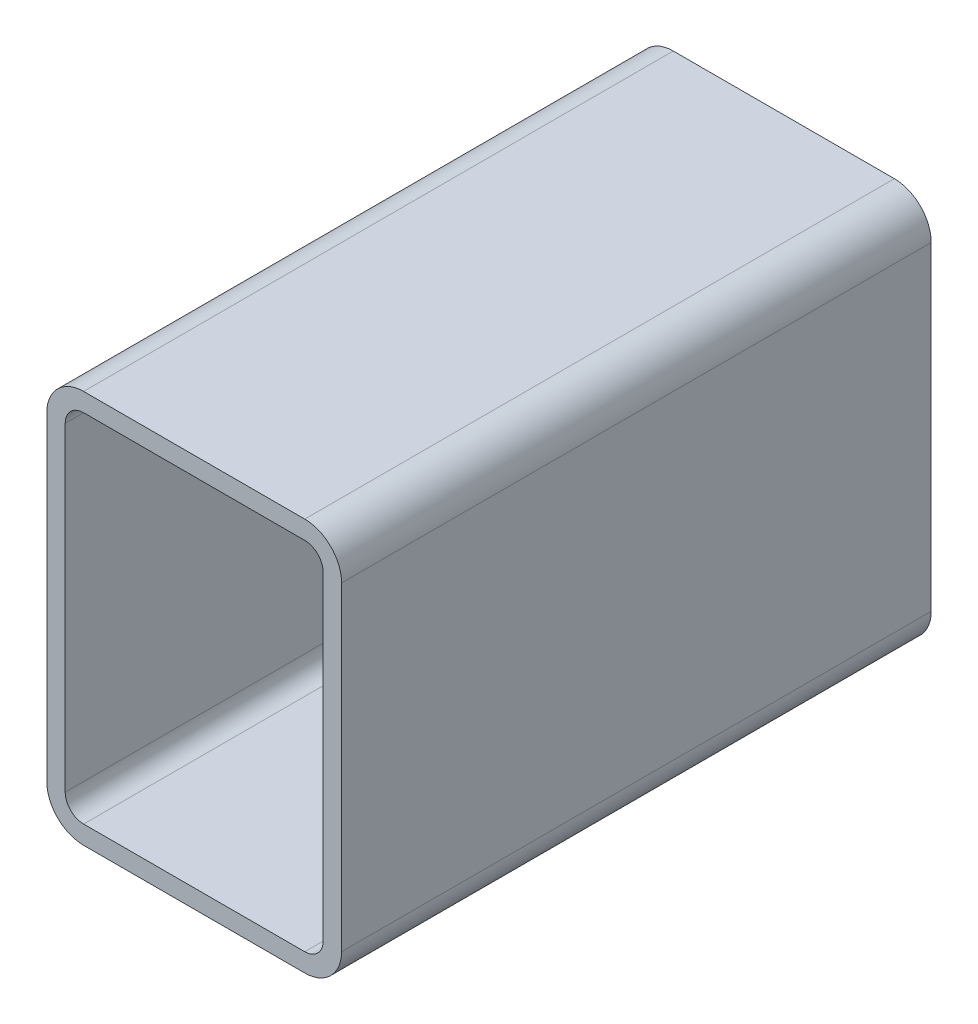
ISO-10303-21;
HEADER;
FILE_DESCRIPTION(('STEP AP214'),'2;1');
FILE_NAME('part.step','',(''),(''),'','','');
FILE_SCHEMA(('AUTOMOTIVE_DESIGN { 1 0 10303 214 1 1 1 1 }'));
ENDSEC;
DATA;
#1=APPLICATION_CONTEXT('core data for automotive mechanical design processes');
#2=APPLICATION_PROTOCOL_DEFINITION('international standard','automotive_design',2000,#1);
#3=PRODUCT_CONTEXT('',#1,'mechanical');
#4=PRODUCT('Part','Part','',(#3));
#5=PRODUCT_RELATED_PRODUCT_CATEGORY('part','',(#4));
#6=PRODUCT_DEFINITION_FORMATION('','',#4);
#7=PRODUCT_DEFINITION_CONTEXT('part definition',#1,'design');
#8=PRODUCT_DEFINITION('design','',#6,#7);
#9=PRODUCT_DEFINITION_SHAPE('','',#8);
#10=(LENGTH_UNIT() NAMED_UNIT(*) SI_UNIT(.MILLI.,.METRE.));
#11=(NAMED_UNIT(*) PLANE_ANGLE_UNIT() SI_UNIT($,.RADIAN.));
#12=(NAMED_UNIT(*) SI_UNIT($,.STERADIAN.) SOLID_ANGLE_UNIT());
#13=UNCERTAINTY_MEASURE_WITH_UNIT(LENGTH_MEASURE(1.E-05),#10,'distance_accuracy_value','');
#14=(GEOMETRIC_REPRESENTATION_CONTEXT(3) GLOBAL_UNCERTAINTY_ASSIGNED_CONTEXT((#13)) GLOBAL_UNIT_ASSIGNED_CONTEXT((#10,
#11,#12)) REPRESENTATION_CONTEXT('',''));
#15=CARTESIAN_POINT('',(0.,0.,0.));
#16=DIRECTION('',(0.,0.,1.));
#17=DIRECTION('',(1.,0.,0.));
#18=AXIS2_PLACEMENT_3D('',#15,#16,#17);
#19=CARTESIAN_POINT('',(19.0973013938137,186.116130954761,304.8));
#20=DIRECTION('',(0.,0.,1.));
#21=DIRECTION('',(1.,0.,0.));
#22=AXIS2_PLACEMENT_3D('',#19,#20,#21);
#23=PLANE('',#22);
#24=CARTESIAN_POINT('',(19.0973013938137,186.116130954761,304.8));
#25=DIRECTION('',(0.,0.,1.));
#26=DIRECTION('',(1.,0.,0.));
#27=AXIS2_PLACEMENT_3D('',#24,#25,#26);
#28=CIRCLE('',#27,19.05);
#29=CARTESIAN_POINT('',(19.0973013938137,205.166130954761,304.8));
#30=VERTEX_POINT('',#29);
#31=CARTESIAN_POINT('',(0.0473013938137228,186.116130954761,304.8));
#32=VERTEX_POINT('',#31);
#33=EDGE_CURVE('E211',#30,#32,#28,.T.);
#34=ORIENTED_EDGE('',*,*,#33,.T.);
#35=DIRECTION('',(0.,-1.,0.));
#36=VECTOR('',#35,1.);
#37=CARTESIAN_POINT('',(0.0473013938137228,21.0161309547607,304.8));
#38=LINE('',#37,#36);
#39=CARTESIAN_POINT('',(0.0473013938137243,21.0161309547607,304.8));
#40=VERTEX_POINT('',#39);
#41=EDGE_CURVE('E214',#32,#40,#38,.T.);
#42=ORIENTED_EDGE('',*,*,#41,.T.);
#43=CARTESIAN_POINT('',(19.0973013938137,21.0161309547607,304.8));
#44=DIRECTION('',(0.,0.,1.));
#45=DIRECTION('',(1.,0.,0.));
#46=AXIS2_PLACEMENT_3D('',#43,#44,#45);
#47=CIRCLE('',#46,19.05);
#48=CARTESIAN_POINT('',(19.0973013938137,1.96613095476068,304.8));
#49=VERTEX_POINT('',#48);
#50=EDGE_CURVE('E217',#40,#49,#47,.T.);
#51=ORIENTED_EDGE('',*,*,#50,.T.);
#52=DIRECTION('',(1.,0.,0.));
#53=VECTOR('',#52,1.);
#54=CARTESIAN_POINT('',(133.397301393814,1.96613095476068,304.8));
#55=LINE('',#54,#53);
#56=CARTESIAN_POINT('',(133.397301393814,1.96613095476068,304.8));
#57=VERTEX_POINT('',#56);
#58=EDGE_CURVE('E219',#49,#57,#55,.T.);
#59=ORIENTED_EDGE('',*,*,#58,.T.);
#60=CARTESIAN_POINT('',(133.397301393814,21.0161309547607,304.8));
#61=DIRECTION('',(0.,0.,1.));
#62=DIRECTION('',(1.,0.,0.));
#63=AXIS2_PLACEMENT_3D('',#60,#61,#62);
#64=CIRCLE('',#63,19.05);
#65=CARTESIAN_POINT('',(152.447301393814,21.0161309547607,304.8));
#66=VERTEX_POINT('',#65);
#67=EDGE_CURVE('E221',#57,#66,#64,.T.);
#68=ORIENTED_EDGE('',*,*,#67,.T.);
#69=DIRECTION('',(0.,1.,0.));
#70=VECTOR('',#69,1.);
#71=CARTESIAN_POINT('',(152.447301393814,186.116130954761,304.8));
#72=LINE('',#71,#70);
#73=CARTESIAN_POINT('',(152.447301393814,186.116130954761,304.8));
#74=VERTEX_POINT('',#73);
#75=EDGE_CURVE('E223',#66,#74,#72,.T.);
#76=ORIENTED_EDGE('',*,*,#75,.T.);
#77=CARTESIAN_POINT('',(133.397301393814,186.116130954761,304.8));
#78=DIRECTION('',(0.,0.,1.));
#79=DIRECTION('',(1.,0.,0.));
#80=AXIS2_PLACEMENT_3D('',#77,#78,#79);
#81=CIRCLE('',#80,19.05);
#82=CARTESIAN_POINT('',(133.397301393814,205.166130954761,304.8));
#83=VERTEX_POINT('',#82);
#84=EDGE_CURVE('E225',#74,#83,#81,.T.);
#85=ORIENTED_EDGE('',*,*,#84,.T.);
#86=DIRECTION('',(-1.,0.,0.));
#87=VECTOR('',#86,1.);
#88=CARTESIAN_POINT('',(19.0973013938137,205.166130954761,304.8));
#89=LINE('',#88,#87);
#90=EDGE_CURVE('E227',#83,#30,#89,.T.);
#91=ORIENTED_EDGE('',*,*,#90,.T.);
#92=EDGE_LOOP('',(#34,#42,#51,#59,#68,#76,#85,#91));
#93=FACE_BOUND('',#92,.T.);
#94=DIRECTION('',(0.,-1.,0.));
#95=VECTOR('',#94,1.);
#96=CARTESIAN_POINT('',(9.57230139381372,21.0161309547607,304.8));
#97=LINE('',#96,#95);
#98=CARTESIAN_POINT('',(9.57230139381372,186.116130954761,304.8));
#99=VERTEX_POINT('',#98);
#100=CARTESIAN_POINT('',(9.57230139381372,21.0161309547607,304.8));
#101=VERTEX_POINT('',#100);
#102=EDGE_CURVE('E154',#99,#101,#97,.T.);
#103=ORIENTED_EDGE('',*,*,#102,.F.);
#104=CARTESIAN_POINT('',(19.0973013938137,186.116130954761,304.8));
#105=DIRECTION('',(0.,0.,1.));
#106=DIRECTION('',(1.,0.,0.));
#107=AXIS2_PLACEMENT_3D('',#104,#105,#106);
#108=CIRCLE('',#107,9.52500000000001);
#109=CARTESIAN_POINT('',(19.0973013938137,195.641130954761,304.8));
#110=VERTEX_POINT('',#109);
#111=EDGE_CURVE('E146',#110,#99,#108,.T.);
#112=ORIENTED_EDGE('',*,*,#111,.F.);
#113=DIRECTION('',(-1.,0.,0.));
#114=VECTOR('',#113,1.);
#115=CARTESIAN_POINT('',(19.0973013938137,195.641130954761,304.8));
#116=LINE('',#115,#114);
#117=CARTESIAN_POINT('',(133.397301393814,195.641130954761,304.8));
#118=VERTEX_POINT('',#117);
#119=EDGE_CURVE('E179',#118,#110,#116,.T.);
#120=ORIENTED_EDGE('',*,*,#119,.F.);
#121=CARTESIAN_POINT('',(133.397301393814,186.116130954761,304.8));
#122=DIRECTION('',(0.,0.,1.));
#123=DIRECTION('',(1.,0.,0.));
#124=AXIS2_PLACEMENT_3D('',#121,#122,#123);
#125=CIRCLE('',#124,9.52500000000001);
#126=CARTESIAN_POINT('',(142.922301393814,186.116130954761,304.8));
#127=VERTEX_POINT('',#126);
#128=EDGE_CURVE('E177',#127,#118,#125,.T.);
#129=ORIENTED_EDGE('',*,*,#128,.F.);
#130=DIRECTION('',(0.,1.,0.));
#131=VECTOR('',#130,1.);
#132=CARTESIAN_POINT('',(142.922301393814,186.116130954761,304.8));
#133=LINE('',#132,#131);
#134=CARTESIAN_POINT('',(142.922301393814,21.0161309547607,304.8));
#135=VERTEX_POINT('',#134);
#136=EDGE_CURVE('E175',#135,#127,#133,.T.);
#137=ORIENTED_EDGE('',*,*,#136,.F.);
#138=CARTESIAN_POINT('',(133.397301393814,21.0161309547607,304.8));
#139=DIRECTION('',(0.,0.,1.));
#140=DIRECTION('',(1.,0.,0.));
#141=AXIS2_PLACEMENT_3D('',#138,#139,#140);
#142=CIRCLE('',#141,9.525);
#143=CARTESIAN_POINT('',(133.397301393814,11.4911309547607,304.8));
#144=VERTEX_POINT('',#143);
#145=EDGE_CURVE('E173',#144,#135,#142,.T.);
#146=ORIENTED_EDGE('',*,*,#145,.F.);
#147=DIRECTION('',(1.,0.,0.));
#148=VECTOR('',#147,1.);
#149=CARTESIAN_POINT('',(133.397301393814,11.4911309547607,304.8));
#150=LINE('',#149,#148);
#151=CARTESIAN_POINT('',(19.0973013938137,11.4911309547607,304.8));
#152=VERTEX_POINT('',#151);
#153=EDGE_CURVE('E169',#152,#144,#150,.T.);
#154=ORIENTED_EDGE('',*,*,#153,.F.);
#155=CARTESIAN_POINT('',(19.0973013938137,21.0161309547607,304.8));
#156=DIRECTION('',(0.,0.,1.));
#157=DIRECTION('',(1.,0.,0.));
#158=AXIS2_PLACEMENT_3D('',#155,#156,#157);
#159=CIRCLE('',#158,9.525);
#160=EDGE_CURVE('E167',#101,#152,#159,.T.);
#161=ORIENTED_EDGE('',*,*,#160,.F.);
#162=EDGE_LOOP('',(#103,#112,#120,#129,#137,#146,#154,#161));
#163=FACE_BOUND('',#162,.T.);
#164=ADVANCED_FACE('F33',(#93,#163),#23,.T.);
#165=CARTESIAN_POINT('',(19.0973013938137,186.116130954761,0.));
#166=DIRECTION('',(0.,0.,1.));
#167=DIRECTION('',(1.,0.,0.));
#168=AXIS2_PLACEMENT_3D('',#165,#166,#167);
#169=PLANE('',#168);
#170=CARTESIAN_POINT('',(19.0973013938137,186.116130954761,0.));
#171=DIRECTION('',(0.,0.,1.));
#172=DIRECTION('',(1.,0.,0.));
#173=AXIS2_PLACEMENT_3D('',#170,#171,#172);
#174=CIRCLE('',#173,19.05);
#175=CARTESIAN_POINT('',(19.0973013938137,205.166130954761,0.));
#176=VERTEX_POINT('',#175);
#177=CARTESIAN_POINT('',(0.0473013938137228,186.116130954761,0.));
#178=VERTEX_POINT('',#177);
#179=EDGE_CURVE('E162',#176,#178,#174,.T.);
#180=ORIENTED_EDGE('',*,*,#179,.F.);
#181=DIRECTION('',(-1.,0.,0.));
#182=VECTOR('',#181,1.);
#183=CARTESIAN_POINT('',(19.0973013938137,205.166130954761,0.));
#184=LINE('',#183,#182);
#185=CARTESIAN_POINT('',(133.397301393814,205.166130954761,0.));
#186=VERTEX_POINT('',#185);
#187=EDGE_CURVE('E215',#186,#176,#184,.T.);
#188=ORIENTED_EDGE('',*,*,#187,.F.);
#189=CARTESIAN_POINT('',(133.397301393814,186.116130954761,0.));
#190=DIRECTION('',(0.,0.,1.));
#191=DIRECTION('',(1.,0.,0.));
#192=AXIS2_PLACEMENT_3D('',#189,#190,#191);
#193=CIRCLE('',#192,19.05);
#194=CARTESIAN_POINT('',(152.447301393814,186.116130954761,0.));
#195=VERTEX_POINT('',#194);
#196=EDGE_CURVE('E242',#195,#186,#193,.T.);
#197=ORIENTED_EDGE('',*,*,#196,.F.);
#198=DIRECTION('',(0.,1.,0.));
#199=VECTOR('',#198,1.);
#200=CARTESIAN_POINT('',(152.447301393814,186.116130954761,0.));
#201=LINE('',#200,#199);
#202=CARTESIAN_POINT('',(152.447301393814,21.0161309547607,0.));
#203=VERTEX_POINT('',#202);
#204=EDGE_CURVE('E240',#203,#195,#201,.T.);
#205=ORIENTED_EDGE('',*,*,#204,.F.);
#206=CARTESIAN_POINT('',(133.397301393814,21.0161309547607,0.));
#207=DIRECTION('',(0.,0.,1.));
#208=DIRECTION('',(1.,0.,0.));
#209=AXIS2_PLACEMENT_3D('',#206,#207,#208);
#210=CIRCLE('',#209,19.05);
#211=CARTESIAN_POINT('',(133.397301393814,1.96613095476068,0.));
#212=VERTEX_POINT('',#211);
#213=EDGE_CURVE('E238',#212,#203,#210,.T.);
#214=ORIENTED_EDGE('',*,*,#213,.F.);
#215=DIRECTION('',(1.,0.,0.));
#216=VECTOR('',#215,1.);
#217=CARTESIAN_POINT('',(133.397301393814,1.96613095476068,0.));
#218=LINE('',#217,#216);
#219=CARTESIAN_POINT('',(19.0973013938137,1.96613095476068,0.));
#220=VERTEX_POINT('',#219);
#221=EDGE_CURVE('E236',#220,#212,#218,.T.);
#222=ORIENTED_EDGE('',*,*,#221,.F.);
#223=CARTESIAN_POINT('',(19.0973013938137,21.0161309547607,0.));
#224=DIRECTION('',(0.,0.,1.));
#225=DIRECTION('',(1.,0.,0.));
#226=AXIS2_PLACEMENT_3D('',#223,#224,#225);
#227=CIRCLE('',#226,19.05);
#228=CARTESIAN_POINT('',(0.0473013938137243,21.0161309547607,0.));
#229=VERTEX_POINT('',#228);
#230=EDGE_CURVE('E234',#229,#220,#227,.T.);
#231=ORIENTED_EDGE('',*,*,#230,.F.);
#232=DIRECTION('',(0.,-1.,0.));
#233=VECTOR('',#232,1.);
#234=CARTESIAN_POINT('',(0.0473013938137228,21.0161309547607,0.));
#235=LINE('',#234,#233);
#236=EDGE_CURVE('E232',#178,#229,#235,.T.);
#237=ORIENTED_EDGE('',*,*,#236,.F.);
#238=EDGE_LOOP('',(#180,#188,#197,#205,#214,#222,#231,#237));
#239=FACE_BOUND('',#238,.T.);
#240=CARTESIAN_POINT('',(19.0973013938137,186.116130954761,0.));
#241=DIRECTION('',(0.,0.,1.));
#242=DIRECTION('',(1.,0.,0.));
#243=AXIS2_PLACEMENT_3D('',#240,#241,#242);
#244=CIRCLE('',#243,9.52500000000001);
#245=CARTESIAN_POINT('',(19.0973013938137,195.641130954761,0.));
#246=VERTEX_POINT('',#245);
#247=CARTESIAN_POINT('',(9.57230139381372,186.116130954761,0.));
#248=VERTEX_POINT('',#247);
#249=EDGE_CURVE('E56',#246,#248,#244,.T.);
#250=ORIENTED_EDGE('',*,*,#249,.T.);
#251=DIRECTION('',(0.,-1.,0.));
#252=VECTOR('',#251,1.);
#253=CARTESIAN_POINT('',(9.57230139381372,21.0161309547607,0.));
#254=LINE('',#253,#252);
#255=CARTESIAN_POINT('',(9.57230139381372,21.0161309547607,0.));
#256=VERTEX_POINT('',#255);
#257=EDGE_CURVE('E161',#248,#256,#254,.T.);
#258=ORIENTED_EDGE('',*,*,#257,.T.);
#259=CARTESIAN_POINT('',(19.0973013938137,21.0161309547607,0.));
#260=DIRECTION('',(0.,0.,1.));
#261=DIRECTION('',(1.,0.,0.));
#262=AXIS2_PLACEMENT_3D('',#259,#260,#261);
#263=CIRCLE('',#262,9.525);
#264=CARTESIAN_POINT('',(19.0973013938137,11.4911309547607,0.));
#265=VERTEX_POINT('',#264);
#266=EDGE_CURVE('E183',#256,#265,#263,.T.);
#267=ORIENTED_EDGE('',*,*,#266,.T.);
#268=DIRECTION('',(1.,0.,0.));
#269=VECTOR('',#268,1.);
#270=CARTESIAN_POINT('',(133.397301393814,11.4911309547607,0.));
#271=LINE('',#270,#269);
#272=CARTESIAN_POINT('',(133.397301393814,11.4911309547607,0.));
#273=VERTEX_POINT('',#272);
#274=EDGE_CURVE('E186',#265,#273,#271,.T.);
#275=ORIENTED_EDGE('',*,*,#274,.T.);
#276=CARTESIAN_POINT('',(133.397301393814,21.0161309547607,0.));
#277=DIRECTION('',(0.,0.,1.));
#278=DIRECTION('',(1.,0.,0.));
#279=AXIS2_PLACEMENT_3D('',#276,#277,#278);
#280=CIRCLE('',#279,9.525);
#281=CARTESIAN_POINT('',(142.922301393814,21.0161309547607,0.));
#282=VERTEX_POINT('',#281);
#283=EDGE_CURVE('E189',#273,#282,#280,.T.);
#284=ORIENTED_EDGE('',*,*,#283,.T.);
#285=DIRECTION('',(0.,1.,0.));
#286=VECTOR('',#285,1.);
#287=CARTESIAN_POINT('',(142.922301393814,186.116130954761,0.));
#288=LINE('',#287,#286);
#289=CARTESIAN_POINT('',(142.922301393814,186.116130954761,0.));
#290=VERTEX_POINT('',#289);
#291=EDGE_CURVE('E192',#282,#290,#288,.T.);
#292=ORIENTED_EDGE('',*,*,#291,.T.);
#293=CARTESIAN_POINT('',(133.397301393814,186.116130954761,0.));
#294=DIRECTION('',(0.,0.,1.));
#295=DIRECTION('',(1.,0.,0.));
#296=AXIS2_PLACEMENT_3D('',#293,#294,#295);
#297=CIRCLE('',#296,9.52500000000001);
#298=CARTESIAN_POINT('',(133.397301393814,195.641130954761,0.));
#299=VERTEX_POINT('',#298);
#300=EDGE_CURVE('E195',#290,#299,#297,.T.);
#301=ORIENTED_EDGE('',*,*,#300,.T.);
#302=DIRECTION('',(-1.,0.,0.));
#303=VECTOR('',#302,1.);
#304=CARTESIAN_POINT('',(19.0973013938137,195.641130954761,0.));
#305=LINE('',#304,#303);
#306=EDGE_CURVE('E155',#299,#246,#305,.T.);
#307=ORIENTED_EDGE('',*,*,#306,.T.);
#308=EDGE_LOOP('',(#250,#258,#267,#275,#284,#292,#301,#307));
#309=FACE_BOUND('',#308,.T.);
#310=ADVANCED_FACE('F272',(#239,#309),#169,.F.);
#311=CARTESIAN_POINT('',(19.0973013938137,186.116130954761,304.8));
#312=DIRECTION('',(0.,0.,-1.));
#313=DIRECTION('',(-1.,0.,0.));
#314=AXIS2_PLACEMENT_3D('',#311,#312,#313);
#315=CYLINDRICAL_SURFACE('',#314,19.05);
#316=ORIENTED_EDGE('',*,*,#179,.T.);
#317=DIRECTION('',(0.,0.,-1.));
#318=VECTOR('',#317,1.);
#319=CARTESIAN_POINT('',(0.0473013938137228,186.116130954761,304.8));
#320=LINE('',#319,#318);
#321=EDGE_CURVE('E11',#32,#178,#320,.T.);
#322=ORIENTED_EDGE('',*,*,#321,.F.);
#323=ORIENTED_EDGE('',*,*,#33,.F.);
#324=DIRECTION('',(0.,0.,-1.));
#325=VECTOR('',#324,1.);
#326=CARTESIAN_POINT('',(19.0973013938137,205.166130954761,304.8));
#327=LINE('',#326,#325);
#328=EDGE_CURVE('E229',#30,#176,#327,.T.);
#329=ORIENTED_EDGE('',*,*,#328,.T.);
#330=EDGE_LOOP('',(#316,#322,#323,#329));
#331=FACE_BOUND('',#330,.T.);
#332=ADVANCED_FACE('F35',(#331),#315,.T.);
#333=CARTESIAN_POINT('',(0.0473013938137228,21.0161309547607,304.8));
#334=DIRECTION('',(1.,0.,0.));
#335=DIRECTION('',(0.,0.,-1.));
#336=AXIS2_PLACEMENT_3D('',#333,#334,#335);
#337=PLANE('',#336);
#338=ORIENTED_EDGE('',*,*,#236,.T.);
#339=DIRECTION('',(0.,0.,-1.));
#340=VECTOR('',#339,1.);
#341=CARTESIAN_POINT('',(0.0473013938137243,21.0161309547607,304.8));
#342=LINE('',#341,#340);
#343=EDGE_CURVE('E41',#40,#229,#342,.T.);
#344=ORIENTED_EDGE('',*,*,#343,.F.);
#345=ORIENTED_EDGE('',*,*,#41,.F.);
#346=ORIENTED_EDGE('',*,*,#321,.T.);
#347=EDGE_LOOP('',(#338,#344,#345,#346));
#348=FACE_BOUND('',#347,.T.);
#349=ADVANCED_FACE('F289',(#348),#337,.F.);
#350=CARTESIAN_POINT('',(19.0973013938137,21.0161309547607,304.8));
#351=DIRECTION('',(0.,0.,-1.));
#352=DIRECTION('',(-1.,0.,0.));
#353=AXIS2_PLACEMENT_3D('',#350,#351,#352);
#354=CYLINDRICAL_SURFACE('',#353,19.05);
#355=ORIENTED_EDGE('',*,*,#230,.T.);
#356=DIRECTION('',(0.,0.,-1.));
#357=VECTOR('',#356,1.);
#358=CARTESIAN_POINT('',(19.0973013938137,1.96613095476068,304.8));
#359=LINE('',#358,#357);
#360=EDGE_CURVE('E259',#49,#220,#359,.T.);
#361=ORIENTED_EDGE('',*,*,#360,.F.);
#362=ORIENTED_EDGE('',*,*,#50,.F.);
#363=ORIENTED_EDGE('',*,*,#343,.T.);
#364=EDGE_LOOP('',(#355,#361,#362,#363));
#365=FACE_BOUND('',#364,.T.);
#366=ADVANCED_FACE('F266',(#365),#354,.T.);
#367=CARTESIAN_POINT('',(133.397301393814,1.96613095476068,304.8));
#368=DIRECTION('',(0.,1.,0.));
#369=DIRECTION('',(0.,0.,1.));
#370=AXIS2_PLACEMENT_3D('',#367,#368,#369);
#371=PLANE('',#370);
#372=ORIENTED_EDGE('',*,*,#221,.T.);
#373=DIRECTION('',(0.,0.,-1.));
#374=VECTOR('',#373,1.);
#375=CARTESIAN_POINT('',(133.397301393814,1.96613095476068,304.8));
#376=LINE('',#375,#374);
#377=EDGE_CURVE('E256',#57,#212,#376,.T.);
#378=ORIENTED_EDGE('',*,*,#377,.F.);
#379=ORIENTED_EDGE('',*,*,#58,.F.);
#380=ORIENTED_EDGE('',*,*,#360,.T.);
#381=EDGE_LOOP('',(#372,#378,#379,#380));
#382=FACE_BOUND('',#381,.T.);
#383=ADVANCED_FACE('F278',(#382),#371,.F.);
#384=CARTESIAN_POINT('',(133.397301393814,21.0161309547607,304.8));
#385=DIRECTION('',(0.,0.,-1.));
#386=DIRECTION('',(-1.,0.,0.));
#387=AXIS2_PLACEMENT_3D('',#384,#385,#386);
#388=CYLINDRICAL_SURFACE('',#387,19.05);
#389=ORIENTED_EDGE('',*,*,#213,.T.);
#390=DIRECTION('',(0.,0.,-1.));
#391=VECTOR('',#390,1.);
#392=CARTESIAN_POINT('',(152.447301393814,21.0161309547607,304.8));
#393=LINE('',#392,#391);
#394=EDGE_CURVE('E253',#66,#203,#393,.T.);
#395=ORIENTED_EDGE('',*,*,#394,.F.);
#396=ORIENTED_EDGE('',*,*,#67,.F.);
#397=ORIENTED_EDGE('',*,*,#377,.T.);
#398=EDGE_LOOP('',(#389,#395,#396,#397));
#399=FACE_BOUND('',#398,.T.);
#400=ADVANCED_FACE('F282',(#399),#388,.T.);
#401=CARTESIAN_POINT('',(152.447301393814,186.116130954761,304.8));
#402=DIRECTION('',(-1.,0.,0.));
#403=DIRECTION('',(0.,0.,1.));
#404=AXIS2_PLACEMENT_3D('',#401,#402,#403);
#405=PLANE('',#404);
#406=ORIENTED_EDGE('',*,*,#204,.T.);
#407=DIRECTION('',(0.,0.,-1.));
#408=VECTOR('',#407,1.);
#409=CARTESIAN_POINT('',(152.447301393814,186.116130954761,304.8));
#410=LINE('',#409,#408);
#411=EDGE_CURVE('E250',#74,#195,#410,.T.);
#412=ORIENTED_EDGE('',*,*,#411,.F.);
#413=ORIENTED_EDGE('',*,*,#75,.F.);
#414=ORIENTED_EDGE('',*,*,#394,.T.);
#415=EDGE_LOOP('',(#406,#412,#413,#414));
#416=FACE_BOUND('',#415,.T.);
#417=ADVANCED_FACE('F302',(#416),#405,.F.);
#418=CARTESIAN_POINT('',(133.397301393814,186.116130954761,304.8));
#419=DIRECTION('',(0.,0.,-1.));
#420=DIRECTION('',(-1.,0.,0.));
#421=AXIS2_PLACEMENT_3D('',#418,#419,#420);
#422=CYLINDRICAL_SURFACE('',#421,19.05);
#423=ORIENTED_EDGE('',*,*,#196,.T.);
#424=DIRECTION('',(0.,0.,-1.));
#425=VECTOR('',#424,1.);
#426=CARTESIAN_POINT('',(133.397301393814,205.166130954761,304.8));
#427=LINE('',#426,#425);
#428=EDGE_CURVE('E247',#83,#186,#427,.T.);
#429=ORIENTED_EDGE('',*,*,#428,.F.);
#430=ORIENTED_EDGE('',*,*,#84,.F.);
#431=ORIENTED_EDGE('',*,*,#411,.T.);
#432=EDGE_LOOP('',(#423,#429,#430,#431));
#433=FACE_BOUND('',#432,.T.);
#434=ADVANCED_FACE('F300',(#433),#422,.T.);
#435=CARTESIAN_POINT('',(19.0973013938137,205.166130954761,304.8));
#436=DIRECTION('',(0.,-1.,0.));
#437=DIRECTION('',(0.,0.,-1.));
#438=AXIS2_PLACEMENT_3D('',#435,#436,#437);
#439=PLANE('',#438);
#440=ORIENTED_EDGE('',*,*,#187,.T.);
#441=ORIENTED_EDGE('',*,*,#328,.F.);
#442=ORIENTED_EDGE('',*,*,#90,.F.);
#443=ORIENTED_EDGE('',*,*,#428,.T.);
#444=EDGE_LOOP('',(#440,#441,#442,#443));
#445=FACE_BOUND('',#444,.T.);
#446=ADVANCED_FACE('F295',(#445),#439,.F.);
#447=CARTESIAN_POINT('',(19.0973013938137,186.116130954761,304.8));
#448=DIRECTION('',(0.,0.,-1.));
#449=DIRECTION('',(-1.,0.,0.));
#450=AXIS2_PLACEMENT_3D('',#447,#448,#449);
#451=CYLINDRICAL_SURFACE('',#450,9.52500000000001);
#452=ORIENTED_EDGE('',*,*,#249,.F.);
#453=DIRECTION('',(0.,0.,-1.));
#454=VECTOR('',#453,1.);
#455=CARTESIAN_POINT('',(19.0973013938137,195.641130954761,304.8));
#456=LINE('',#455,#454);
#457=EDGE_CURVE('E150',#110,#246,#456,.T.);
#458=ORIENTED_EDGE('',*,*,#457,.F.);
#459=ORIENTED_EDGE('',*,*,#111,.T.);
#460=DIRECTION('',(0.,0.,-1.));
#461=VECTOR('',#460,1.);
#462=CARTESIAN_POINT('',(9.57230139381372,186.116130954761,304.8));
#463=LINE('',#462,#461);
#464=EDGE_CURVE('E149',#99,#248,#463,.T.);
#465=ORIENTED_EDGE('',*,*,#464,.T.);
#466=EDGE_LOOP('',(#452,#458,#459,#465));
#467=FACE_BOUND('',#466,.T.);
#468=ADVANCED_FACE('F148',(#467),#451,.F.);
#469=CARTESIAN_POINT('',(9.57230139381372,21.0161309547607,304.8));
#470=DIRECTION('',(1.,0.,0.));
#471=DIRECTION('',(0.,0.,-1.));
#472=AXIS2_PLACEMENT_3D('',#469,#470,#471);
#473=PLANE('',#472);
#474=ORIENTED_EDGE('',*,*,#257,.F.);
#475=ORIENTED_EDGE('',*,*,#464,.F.);
#476=ORIENTED_EDGE('',*,*,#102,.T.);
#477=DIRECTION('',(0.,0.,-1.));
#478=VECTOR('',#477,1.);
#479=CARTESIAN_POINT('',(9.57230139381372,21.0161309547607,304.8));
#480=LINE('',#479,#478);
#481=EDGE_CURVE('E163',#101,#256,#480,.T.);
#482=ORIENTED_EDGE('',*,*,#481,.T.);
#483=EDGE_LOOP('',(#474,#475,#476,#482));
#484=FACE_BOUND('',#483,.T.);
#485=ADVANCED_FACE('F158',(#484),#473,.T.);
#486=CARTESIAN_POINT('',(19.0973013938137,21.0161309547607,304.8));
#487=DIRECTION('',(0.,0.,-1.));
#488=DIRECTION('',(-1.,0.,0.));
#489=AXIS2_PLACEMENT_3D('',#486,#487,#488);
#490=CYLINDRICAL_SURFACE('',#489,9.525);
#491=ORIENTED_EDGE('',*,*,#266,.F.);
#492=ORIENTED_EDGE('',*,*,#481,.F.);
#493=ORIENTED_EDGE('',*,*,#160,.T.);
#494=DIRECTION('',(0.,0.,-1.));
#495=VECTOR('',#494,1.);
#496=CARTESIAN_POINT('',(19.0973013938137,11.4911309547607,304.8));
#497=LINE('',#496,#495);
#498=EDGE_CURVE('E208',#152,#265,#497,.T.);
#499=ORIENTED_EDGE('',*,*,#498,.T.);
#500=EDGE_LOOP('',(#491,#492,#493,#499));
#501=FACE_BOUND('',#500,.T.);
#502=ADVANCED_FACE('F327',(#501),#490,.F.);
#503=CARTESIAN_POINT('',(133.397301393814,11.4911309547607,304.8));
#504=DIRECTION('',(0.,1.,0.));
#505=DIRECTION('',(0.,0.,1.));
#506=AXIS2_PLACEMENT_3D('',#503,#504,#505);
#507=PLANE('',#506);
#508=ORIENTED_EDGE('',*,*,#274,.F.);
#509=ORIENTED_EDGE('',*,*,#498,.F.);
#510=ORIENTED_EDGE('',*,*,#153,.T.);
#511=DIRECTION('',(0.,0.,-1.));
#512=VECTOR('',#511,1.);
#513=CARTESIAN_POINT('',(133.397301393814,11.4911309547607,304.8));
#514=LINE('',#513,#512);
#515=EDGE_CURVE('E206',#144,#273,#514,.T.);
#516=ORIENTED_EDGE('',*,*,#515,.T.);
#517=EDGE_LOOP('',(#508,#509,#510,#516));
#518=FACE_BOUND('',#517,.T.);
#519=ADVANCED_FACE('F331',(#518),#507,.T.);
#520=CARTESIAN_POINT('',(133.397301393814,21.0161309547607,304.8));
#521=DIRECTION('',(0.,0.,-1.));
#522=DIRECTION('',(-1.,0.,0.));
#523=AXIS2_PLACEMENT_3D('',#520,#521,#522);
#524=CYLINDRICAL_SURFACE('',#523,9.525);
#525=ORIENTED_EDGE('',*,*,#283,.F.);
#526=ORIENTED_EDGE('',*,*,#515,.F.);
#527=ORIENTED_EDGE('',*,*,#145,.T.);
#528=DIRECTION('',(0.,0.,-1.));
#529=VECTOR('',#528,1.);
#530=CARTESIAN_POINT('',(142.922301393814,21.0161309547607,304.8));
#531=LINE('',#530,#529);
#532=EDGE_CURVE('E204',#135,#282,#531,.T.);
#533=ORIENTED_EDGE('',*,*,#532,.T.);
#534=EDGE_LOOP('',(#525,#526,#527,#533));
#535=FACE_BOUND('',#534,.T.);
#536=ADVANCED_FACE('F337',(#535),#524,.F.);
#537=CARTESIAN_POINT('',(142.922301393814,186.116130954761,304.8));
#538=DIRECTION('',(-1.,0.,0.));
#539=DIRECTION('',(0.,0.,1.));
#540=AXIS2_PLACEMENT_3D('',#537,#538,#539);
#541=PLANE('',#540);
#542=ORIENTED_EDGE('',*,*,#291,.F.);
#543=ORIENTED_EDGE('',*,*,#532,.F.);
#544=ORIENTED_EDGE('',*,*,#136,.T.);
#545=DIRECTION('',(0.,0.,-1.));
#546=VECTOR('',#545,1.);
#547=CARTESIAN_POINT('',(142.922301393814,186.116130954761,304.8));
#548=LINE('',#547,#546);
#549=EDGE_CURVE('E202',#127,#290,#548,.T.);
#550=ORIENTED_EDGE('',*,*,#549,.T.);
#551=EDGE_LOOP('',(#542,#543,#544,#550));
#552=FACE_BOUND('',#551,.T.);
#553=ADVANCED_FACE('F341',(#552),#541,.T.);
#554=CARTESIAN_POINT('',(133.397301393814,186.116130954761,304.8));
#555=DIRECTION('',(0.,0.,-1.));
#556=DIRECTION('',(-1.,0.,0.));
#557=AXIS2_PLACEMENT_3D('',#554,#555,#556);
#558=CYLINDRICAL_SURFACE('',#557,9.52500000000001);
#559=ORIENTED_EDGE('',*,*,#300,.F.);
#560=ORIENTED_EDGE('',*,*,#549,.F.);
#561=ORIENTED_EDGE('',*,*,#128,.T.);
#562=DIRECTION('',(0.,0.,-1.));
#563=VECTOR('',#562,1.);
#564=CARTESIAN_POINT('',(133.397301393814,195.641130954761,304.8));
#565=LINE('',#564,#563);
#566=EDGE_CURVE('E48',#118,#299,#565,.T.);
#567=ORIENTED_EDGE('',*,*,#566,.T.);
#568=EDGE_LOOP('',(#559,#560,#561,#567));
#569=FACE_BOUND('',#568,.T.);
#570=ADVANCED_FACE('F345',(#569),#558,.F.);
#571=CARTESIAN_POINT('',(19.0973013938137,195.641130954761,304.8));
#572=DIRECTION('',(0.,-1.,0.));
#573=DIRECTION('',(0.,0.,-1.));
#574=AXIS2_PLACEMENT_3D('',#571,#572,#573);
#575=PLANE('',#574);
#576=ORIENTED_EDGE('',*,*,#306,.F.);
#577=ORIENTED_EDGE('',*,*,#566,.F.);
#578=ORIENTED_EDGE('',*,*,#119,.T.);
#579=ORIENTED_EDGE('',*,*,#457,.T.);
#580=EDGE_LOOP('',(#576,#577,#578,#579));
#581=FACE_BOUND('',#580,.T.);
#582=ADVANCED_FACE('F349',(#581),#575,.T.);
#583=CLOSED_SHELL('',(#164,#310,#332,#349,#366,#383,#400,#417,#434,#446,#468,#485,#502,#519,
#536,#553,#570,#582));
#584=MANIFOLD_SOLID_BREP('B2',#583);
#585=ADVANCED_BREP_SHAPE_REPRESENTATION('',(#18,#584),#14);
#586=SHAPE_DEFINITION_REPRESENTATION(#9,#585);
ENDSEC;
END-ISO-10303-21;
